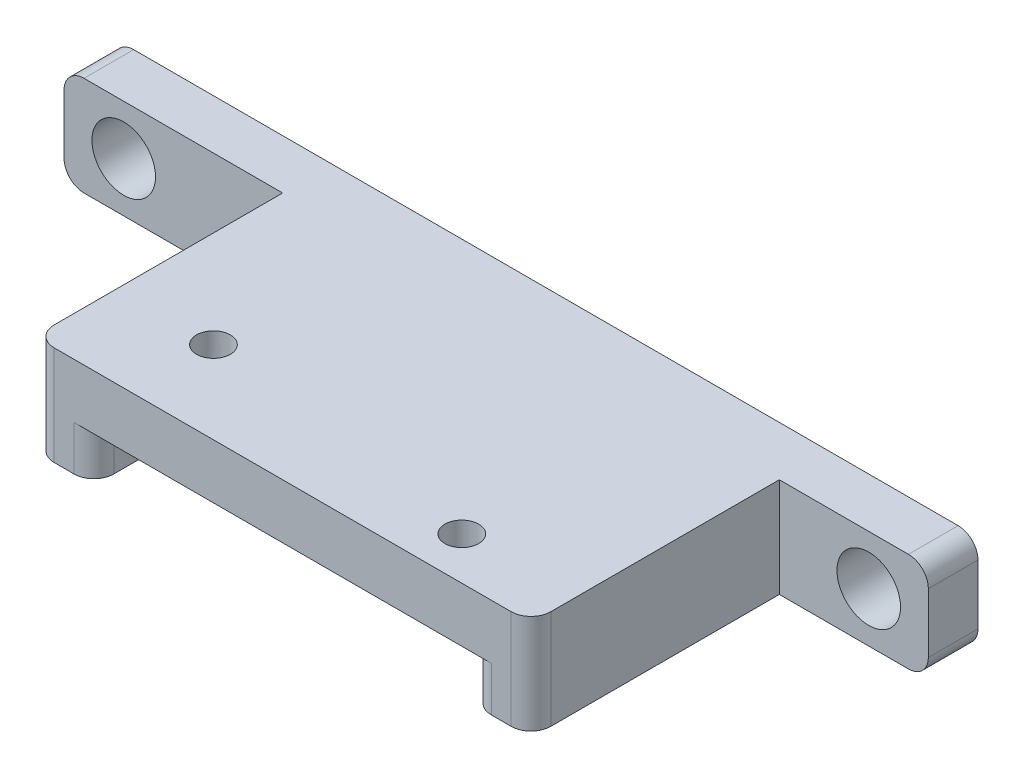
from build123d import *

# Parameters (mm, degrees)
SKETCH_1_W          = 80
SKETCH_1_H          = 30
EXTRUDE_1_DEPTH     = 10
SKETCH_2_W          = 38
SKETCH_2_H          = 18
CUT_EXTRUDE_1_DEPTH = 4.5
SKETCH_3_R          = 1.7
CUT_EXTRUDE_2_DEPTH = 44.874821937
SKETCH_4_R          = 2
CUT_EXTRUDE_3_DEPTH = 4.5
SKETCH_5_W          = 15
SKETCH_5_H          = 10
CUT_EXTRUDE_4_DEPTH = 25
SKETCH_7_W          = 5
SKETCH_7_H          = 10
EXTRUDE_2_DEPTH     = 7
SKETCH_6_R          = 3.2
CUT_EXTRUDE_5_DEPTH = 55.166410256
FILLET_1_R          = 2


with BuildPart() as part:
    # Sketch 1 → Extrude 1 (new body)
    with BuildSketch(Plane(origin=(0, 0, 0), x_dir=(1, 0, 0), z_dir=(0, 1, 0))):
        Rectangle(SKETCH_1_W, SKETCH_1_H)
    extrude(amount=EXTRUDE_1_DEPTH)

    # Sketch 2 → Cut-Extrude 1 (cut)
    with BuildSketch(Plane.XZ):
        with Locations((0, 6)):
            Rectangle(SKETCH_2_W, SKETCH_2_H)
    extrude(amount=-CUT_EXTRUDE_1_DEPTH, mode=Mode.SUBTRACT)

    # Sketch 3 → Cut-Extrude 2 (cut, through all)
    with BuildSketch(Plane(origin=(0, 10, 0), x_dir=(1, 0, 0), z_dir=(0, 1, 0))):
        with Locations(Location((13.732787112, -10.7, 0), (0, 0, 270))):
            Circle(SKETCH_3_R)
        with Locations(Location((-15.267212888, -6.7, 0), (0, 0, 270))):
            Circle(SKETCH_3_R)
    extrude(amount=-CUT_EXTRUDE_2_DEPTH, mode=Mode.SUBTRACT)

    # Sketch 4 → Cut-Extrude 3 (cut)
    with BuildSketch(Plane.XZ):
        with Locations((-17, -3)):
            Circle(SKETCH_4_R)
        with Locations((17, -3)):
            Circle(SKETCH_4_R)
    extrude(amount=-CUT_EXTRUDE_3_DEPTH, mode=Mode.SUBTRACT)

    # Sketch 5 → Cut-Extrude 4 (cut)
    with BuildSketch(Plane.XY.offset(15)):
        with Locations((32.5, 5)):
            Rectangle(SKETCH_5_W, SKETCH_5_H)
        with Locations((-32.5, 5)):
            Rectangle(SKETCH_5_W, SKETCH_5_H)
    extrude(amount=-CUT_EXTRUDE_4_DEPTH, mode=Mode.SUBTRACT)

    # Sketch 7 → Extrude 2 (add)
    with BuildSketch(Plane.ZY.offset(40)):
        with Locations((-12.5, 5)):
            Rectangle(SKETCH_7_W, SKETCH_7_H)
    extrude(amount=EXTRUDE_2_DEPTH)

    # Sketch 6 → Cut-Extrude 5 (cut, through all)
    with BuildSketch(Plane.XY.offset(-10)):
        with Locations((34, 5)):
            Circle(SKETCH_6_R)
        with Locations((-41, 5)):
            Circle(SKETCH_6_R)
    extrude(amount=-CUT_EXTRUDE_5_DEPTH, mode=Mode.SUBTRACT)

    # Fillet 1
    fillet_1_edges = [part.edges().sort_by_distance(p)[0] for p in [
        (-19, 2.25, 15),
        (19, 2.25, 15),
        (40, 0, -12.5),
        (40, 10, -12.5),
        (25, 5, 15),
        (-25, 5, 15),
        (-47, 0, -12.5),
        (-47, 10, -12.5),
    ]]
    fillet(fillet_1_edges, radius=FILLET_1_R)


solid = part.part
